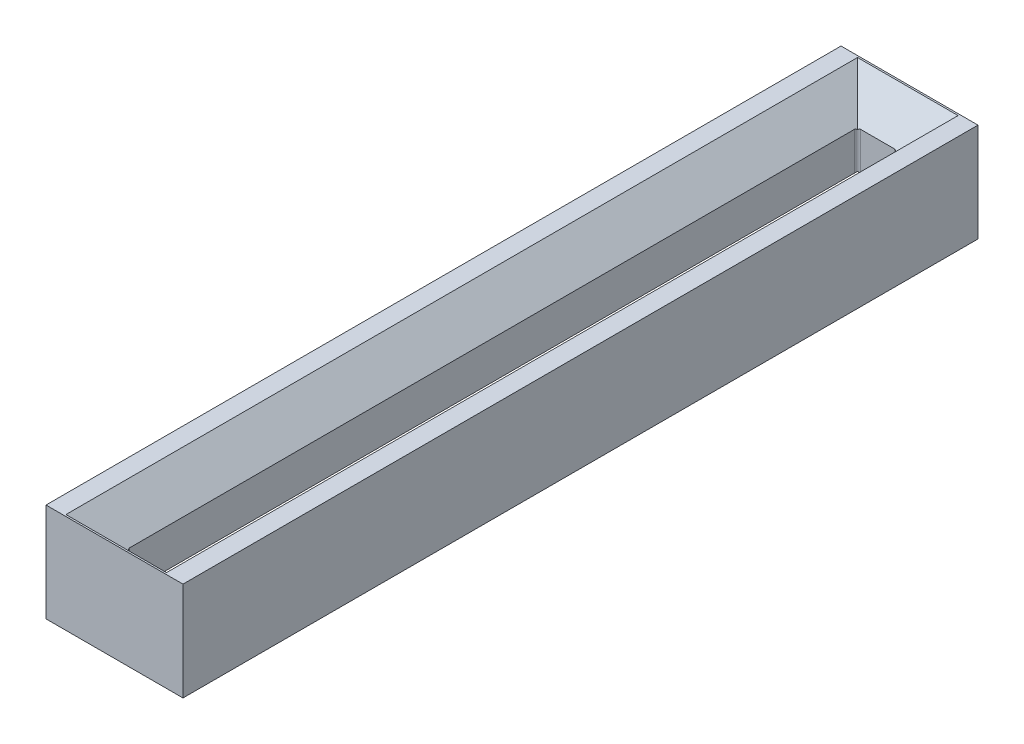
from build123d import *

# Parameters (mm, degrees)
SKETCH2_W               = 564.45
SKETCH2_H               = 3412.05
SKETCH2_W_2             = 164.4
SKETCH2_H_2             = 3012
BOSS_EXTRUDE2_DEPTH     = 203.2
CHAMFER1_SIZE           = 125
FILLET1_R               = 13
CUT_EXTRUDE1_DEPTH      = 1742.109557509
CUT_EXTRUDE1_DEPTH_BACK = 1742.109557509
SKETCH5_W               = 897.579531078
SKETCH5_H               = 197.029653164
SKETCH5_H_2             = 204.539879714


with BuildPart() as part:
    # Sketch2 → Boss-Extrude2 (new, symmetric)
    with BuildSketch(Plane(origin=(0, 0, 0), x_dir=(-1, 0, 0), z_dir=(0, 1, 0))):
        Rectangle(SKETCH2_W, SKETCH2_H)
        Rectangle(SKETCH2_W_2, SKETCH2_H_2, mode=Mode.SUBTRACT)
    extrude(amount=BOSS_EXTRUDE2_DEPTH, both=True)

    # Chamfer1
    chamfer1_edges = [part.edges().sort_by_distance(p)[0] for p in [
        (-82.2, -203.2, 0),
        (0, -203.2, 1506),
        (82.2, -203.2, 0),
        (0, -203.2, -1506),
        (-82.2, 203.2, 0),
        (0, 203.2, 1506),
        (82.2, 203.2, 0),
        (0, 203.2, -1506),
    ]]
    chamfer(chamfer1_edges, length=CHAMFER1_SIZE)

    # Fillet1
    fillet1_edges = [part.edges().sort_by_distance(p)[0] for p in [
        (82.2, 0, 1506),
        (82.2, 0, -1506),
        (-82.2, 0, -1506),
        (-82.2, 0, 1506),
    ]]
    fillet(fillet1_edges, radius=FILLET1_R)

    # Sketch5 → Cut-Extrude1 (cut, two sides: drawn at the far end of the back side and taken through both)
    with BuildSketch(Plane(origin=(0, 0, 0), x_dir=(-1, 0, 0), z_dir=(0, 1, 0)).offset(-CUT_EXTRUDE1_DEPTH_BACK)):
        with Locations((16.020460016, 1736.514826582)):
            Rectangle(SKETCH5_W, SKETCH5_H)
        with Locations((16.020460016, -1740.269939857)):
            Rectangle(SKETCH5_W, SKETCH5_H_2)
    extrude(amount=CUT_EXTRUDE1_DEPTH + CUT_EXTRUDE1_DEPTH_BACK, mode=Mode.SUBTRACT)


solid = part.part
